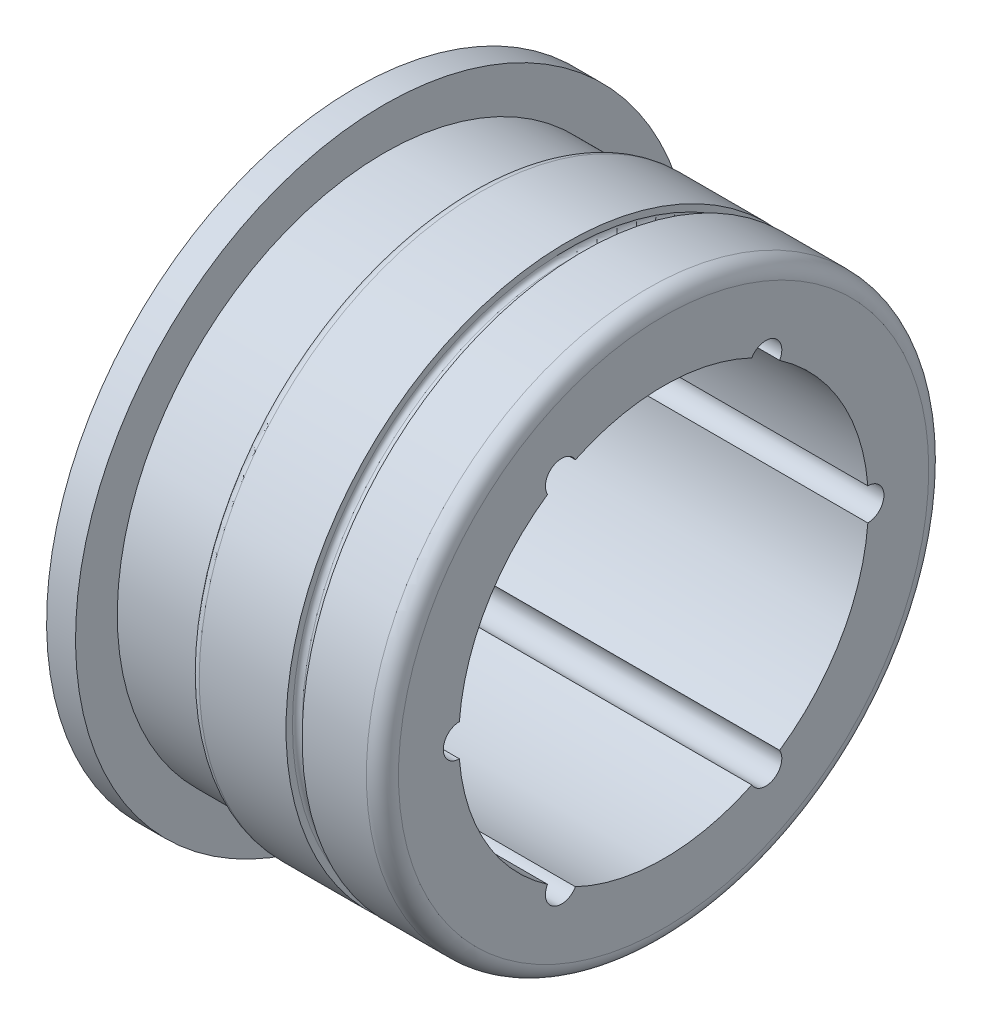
ISO-10303-21;
HEADER;
FILE_DESCRIPTION(('STEP AP214'),'2;1');
FILE_NAME('part.step','',(''),(''),'','','');
FILE_SCHEMA(('AUTOMOTIVE_DESIGN { 1 0 10303 214 1 1 1 1 }'));
ENDSEC;
DATA;
#1=APPLICATION_CONTEXT('core data for automotive mechanical design processes');
#2=APPLICATION_PROTOCOL_DEFINITION('international standard','automotive_design',2000,#1);
#3=PRODUCT_CONTEXT('',#1,'mechanical');
#4=PRODUCT('Part','Part','',(#3));
#5=PRODUCT_RELATED_PRODUCT_CATEGORY('part','',(#4));
#6=PRODUCT_DEFINITION_FORMATION('','',#4);
#7=PRODUCT_DEFINITION_CONTEXT('part definition',#1,'design');
#8=PRODUCT_DEFINITION('design','',#6,#7);
#9=PRODUCT_DEFINITION_SHAPE('','',#8);
#10=(LENGTH_UNIT() NAMED_UNIT(*) SI_UNIT(.MILLI.,.METRE.));
#11=(NAMED_UNIT(*) PLANE_ANGLE_UNIT() SI_UNIT($,.RADIAN.));
#12=(NAMED_UNIT(*) SI_UNIT($,.STERADIAN.) SOLID_ANGLE_UNIT());
#13=UNCERTAINTY_MEASURE_WITH_UNIT(LENGTH_MEASURE(1.E-05),#10,'distance_accuracy_value','');
#14=(GEOMETRIC_REPRESENTATION_CONTEXT(3) GLOBAL_UNCERTAINTY_ASSIGNED_CONTEXT((#13)) GLOBAL_UNIT_ASSIGNED_CONTEXT((#10,
#11,#12)) REPRESENTATION_CONTEXT('',''));
#15=CARTESIAN_POINT('',(0.,0.,0.));
#16=DIRECTION('',(0.,0.,1.));
#17=DIRECTION('',(1.,0.,0.));
#18=AXIS2_PLACEMENT_3D('',#15,#16,#17);
#19=CARTESIAN_POINT('',(28.,-17.770939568,17.71));
#20=DIRECTION('',(1.,0.,0.));
#21=DIRECTION('',(0.,0.,-1.));
#22=AXIS2_PLACEMENT_3D('',#19,#20,#21);
#23=PLANE('',#22);
#24=CARTESIAN_POINT('',(28.,0.,0.));
#25=DIRECTION('',(1.,0.,0.));
#26=DIRECTION('',(0.,0.,-1.));
#27=AXIS2_PLACEMENT_3D('',#24,#25,#26);
#28=CIRCLE('',#27,17.1);
#29=CARTESIAN_POINT('',(28.,0.,-17.1));
#30=VERTEX_POINT('',#29);
#31=EDGE_CURVE('E226',#30,#30,#28,.F.);
#32=ORIENTED_EDGE('',*,*,#31,.T.);
#33=EDGE_LOOP('',(#32));
#34=FACE_BOUND('',#33,.T.);
#35=CARTESIAN_POINT('',(28.,0.,0.));
#36=DIRECTION('',(1.,0.,0.));
#37=DIRECTION('',(0.,0.,-1.));
#38=AXIS2_PLACEMENT_3D('',#35,#36,#37);
#39=CIRCLE('',#38,17.5);
#40=CARTESIAN_POINT('',(28.,0.,-17.5));
#41=VERTEX_POINT('',#40);
#42=EDGE_CURVE('E36',#41,#41,#39,.F.);
#43=ORIENTED_EDGE('',*,*,#42,.F.);
#44=EDGE_LOOP('',(#43));
#45=FACE_BOUND('',#44,.T.);
#46=ADVANCED_FACE('F32',(#34,#45),#23,.T.);
#47=CARTESIAN_POINT('',(22.6,0.,0.));
#48=DIRECTION('',(1.,0.,0.));
#49=DIRECTION('',(0.,0.,-1.));
#50=AXIS2_PLACEMENT_3D('',#47,#48,#49);
#51=CYLINDRICAL_SURFACE('',#50,17.5);
#52=CARTESIAN_POINT('',(22.6,0.,0.));
#53=DIRECTION('',(-1.,0.,0.));
#54=DIRECTION('',(0.,0.,1.));
#55=AXIS2_PLACEMENT_3D('',#52,#53,#54);
#56=CIRCLE('',#55,17.5);
#57=CARTESIAN_POINT('',(22.6,0.,17.5));
#58=VERTEX_POINT('',#57);
#59=EDGE_CURVE('E228',#58,#58,#56,.T.);
#60=ORIENTED_EDGE('',*,*,#59,.F.);
#61=EDGE_LOOP('',(#60));
#62=FACE_BOUND('',#61,.T.);
#63=ORIENTED_EDGE('',*,*,#42,.T.);
#64=EDGE_LOOP('',(#63));
#65=FACE_BOUND('',#64,.T.);
#66=ADVANCED_FACE('F236',(#62,#65),#51,.T.);
#67=CARTESIAN_POINT('',(28.3,0.,0.));
#68=DIRECTION('',(1.,0.,0.));
#69=DIRECTION('',(0.,0.,-1.));
#70=AXIS2_PLACEMENT_3D('',#67,#68,#69);
#71=TOROIDAL_SURFACE('',#70,17.1,0.299999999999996);
#72=ORIENTED_EDGE('',*,*,#31,.F.);
#73=EDGE_LOOP('',(#72));
#74=FACE_BOUND('',#73,.T.);
#75=CARTESIAN_POINT('',(28.3,0.,0.));
#76=DIRECTION('',(1.,0.,0.));
#77=DIRECTION('',(0.,0.,-1.));
#78=AXIS2_PLACEMENT_3D('',#75,#76,#77);
#79=CIRCLE('',#78,16.8);
#80=CARTESIAN_POINT('',(28.3,0.,-16.8));
#81=VERTEX_POINT('',#80);
#82=EDGE_CURVE('E225',#81,#81,#79,.T.);
#83=ORIENTED_EDGE('',*,*,#82,.F.);
#84=EDGE_LOOP('',(#83));
#85=FACE_BOUND('',#84,.T.);
#86=ADVANCED_FACE('F243',(#74,#85),#71,.F.);
#87=CARTESIAN_POINT('',(22.6,0.,0.));
#88=DIRECTION('',(1.,0.,0.));
#89=DIRECTION('',(0.,0.,-1.));
#90=AXIS2_PLACEMENT_3D('',#87,#88,#89);
#91=TOROIDAL_SURFACE('',#90,16.9,0.600000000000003);
#92=CARTESIAN_POINT('',(22.,0.,0.));
#93=DIRECTION('',(1.,0.,0.));
#94=DIRECTION('',(0.,0.,-1.));
#95=AXIS2_PLACEMENT_3D('',#92,#93,#94);
#96=CIRCLE('',#95,16.8999999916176);
#97=CARTESIAN_POINT('',(22.,0.,-16.8999999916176));
#98=VERTEX_POINT('',#97);
#99=EDGE_CURVE('E223',#98,#98,#96,.F.);
#100=ORIENTED_EDGE('',*,*,#99,.F.);
#101=EDGE_LOOP('',(#100));
#102=FACE_BOUND('',#101,.T.);
#103=ORIENTED_EDGE('',*,*,#59,.T.);
#104=EDGE_LOOP('',(#103));
#105=FACE_BOUND('',#104,.T.);
#106=ADVANCED_FACE('F313',(#102,#105),#91,.T.);
#107=CARTESIAN_POINT('',(28.3,0.,0.));
#108=DIRECTION('',(1.,0.,0.));
#109=DIRECTION('',(0.,1.,0.));
#110=AXIS2_PLACEMENT_3D('',#107,#108,#109);
#111=CYLINDRICAL_SURFACE('',#110,16.8);
#112=ORIENTED_EDGE('',*,*,#82,.T.);
#113=EDGE_LOOP('',(#112));
#114=FACE_BOUND('',#113,.T.);
#115=CARTESIAN_POINT('',(28.7,0.,0.));
#116=DIRECTION('',(-1.,0.,0.));
#117=DIRECTION('',(0.,-1.,0.));
#118=AXIS2_PLACEMENT_3D('',#115,#116,#117);
#119=CIRCLE('',#118,16.8);
#120=CARTESIAN_POINT('',(28.7,-16.8,0.));
#121=VERTEX_POINT('',#120);
#122=EDGE_CURVE('E222',#121,#121,#119,.T.);
#123=ORIENTED_EDGE('',*,*,#122,.T.);
#124=EDGE_LOOP('',(#123));
#125=FACE_BOUND('',#124,.T.);
#126=ADVANCED_FACE('F310',(#114,#125),#111,.T.);
#127=CARTESIAN_POINT('',(22.,-17.161650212,-17.1028));
#128=DIRECTION('',(-1.,0.,0.));
#129=DIRECTION('',(0.,0.,1.));
#130=AXIS2_PLACEMENT_3D('',#127,#128,#129);
#131=PLANE('',#130);
#132=CARTESIAN_POINT('',(22.,0.,0.));
#133=DIRECTION('',(1.,0.,0.));
#134=DIRECTION('',(0.,1.,0.));
#135=AXIS2_PLACEMENT_3D('',#132,#133,#134);
#136=CIRCLE('',#135,16.6);
#137=CARTESIAN_POINT('',(22.,16.6,0.));
#138=VERTEX_POINT('',#137);
#139=EDGE_CURVE('E219',#138,#138,#136,.F.);
#140=ORIENTED_EDGE('',*,*,#139,.F.);
#141=EDGE_LOOP('',(#140));
#142=FACE_BOUND('',#141,.T.);
#143=ORIENTED_EDGE('',*,*,#99,.T.);
#144=EDGE_LOOP('',(#143));
#145=FACE_BOUND('',#144,.T.);
#146=ADVANCED_FACE('F312',(#142,#145),#131,.T.);
#147=CARTESIAN_POINT('',(28.7,0.,0.));
#148=DIRECTION('',(1.,0.,0.));
#149=DIRECTION('',(0.,1.,0.));
#150=AXIS2_PLACEMENT_3D('',#147,#148,#149);
#151=TOROIDAL_SURFACE('',#150,17.1,0.300000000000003);
#152=ORIENTED_EDGE('',*,*,#122,.F.);
#153=EDGE_LOOP('',(#152));
#154=FACE_BOUND('',#153,.T.);
#155=CARTESIAN_POINT('',(29.,0.,0.));
#156=DIRECTION('',(1.,0.,0.));
#157=DIRECTION('',(0.,1.,0.));
#158=AXIS2_PLACEMENT_3D('',#155,#156,#157);
#159=CIRCLE('',#158,17.09999998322);
#160=CARTESIAN_POINT('',(29.,17.09999998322,0.));
#161=VERTEX_POINT('',#160);
#162=EDGE_CURVE('E216',#161,#161,#159,.T.);
#163=ORIENTED_EDGE('',*,*,#162,.F.);
#164=EDGE_LOOP('',(#163));
#165=FACE_BOUND('',#164,.T.);
#166=ADVANCED_FACE('F308',(#154,#165),#151,.F.);
#167=CARTESIAN_POINT('',(16.6,0.,0.));
#168=DIRECTION('',(1.,0.,0.));
#169=DIRECTION('',(0.,1.,0.));
#170=AXIS2_PLACEMENT_3D('',#167,#168,#169);
#171=CYLINDRICAL_SURFACE('',#170,16.6);
#172=CARTESIAN_POINT('',(16.6,0.,0.));
#173=DIRECTION('',(1.,0.,0.));
#174=DIRECTION('',(0.,1.,0.));
#175=AXIS2_PLACEMENT_3D('',#172,#173,#174);
#176=CIRCLE('',#175,16.6);
#177=CARTESIAN_POINT('',(16.6,16.6,0.));
#178=VERTEX_POINT('',#177);
#179=EDGE_CURVE('E213',#178,#178,#176,.F.);
#180=ORIENTED_EDGE('',*,*,#179,.F.);
#181=EDGE_LOOP('',(#180));
#182=FACE_BOUND('',#181,.T.);
#183=ORIENTED_EDGE('',*,*,#139,.T.);
#184=EDGE_LOOP('',(#183));
#185=FACE_BOUND('',#184,.T.);
#186=ADVANCED_FACE('F304',(#182,#185),#171,.T.);
#187=CARTESIAN_POINT('',(29.,-17.770939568,-17.71));
#188=DIRECTION('',(-1.,0.,0.));
#189=DIRECTION('',(0.,0.,1.));
#190=AXIS2_PLACEMENT_3D('',#187,#188,#189);
#191=PLANE('',#190);
#192=ORIENTED_EDGE('',*,*,#162,.T.);
#193=EDGE_LOOP('',(#192));
#194=FACE_BOUND('',#193,.T.);
#195=CARTESIAN_POINT('',(29.,0.,0.));
#196=DIRECTION('',(1.,0.,0.));
#197=DIRECTION('',(0.,0.,-1.));
#198=AXIS2_PLACEMENT_3D('',#195,#196,#197);
#199=CIRCLE('',#198,17.5);
#200=CARTESIAN_POINT('',(29.,0.,-17.5));
#201=VERTEX_POINT('',#200);
#202=EDGE_CURVE('E210',#201,#201,#199,.T.);
#203=ORIENTED_EDGE('',*,*,#202,.F.);
#204=EDGE_LOOP('',(#203));
#205=FACE_BOUND('',#204,.T.);
#206=ADVANCED_FACE('F307',(#194,#205),#191,.T.);
#207=CARTESIAN_POINT('',(16.6,-19.497259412,19.4304));
#208=DIRECTION('',(1.,0.,0.));
#209=DIRECTION('',(0.,0.,-1.));
#210=AXIS2_PLACEMENT_3D('',#207,#208,#209);
#211=PLANE('',#210);
#212=ORIENTED_EDGE('',*,*,#179,.T.);
#213=EDGE_LOOP('',(#212));
#214=FACE_BOUND('',#213,.T.);
#215=CARTESIAN_POINT('',(16.6,0.,0.));
#216=DIRECTION('',(1.,0.,0.));
#217=DIRECTION('',(0.,1.,0.));
#218=AXIS2_PLACEMENT_3D('',#215,#216,#217);
#219=CIRCLE('',#218,19.2);
#220=CARTESIAN_POINT('',(16.6,19.2,0.));
#221=VERTEX_POINT('',#220);
#222=EDGE_CURVE('E206',#221,#221,#219,.F.);
#223=ORIENTED_EDGE('',*,*,#222,.F.);
#224=EDGE_LOOP('',(#223));
#225=FACE_BOUND('',#224,.T.);
#226=ADVANCED_FACE('F302',(#214,#225),#211,.T.);
#227=CARTESIAN_POINT('',(29.,0.,0.));
#228=DIRECTION('',(1.,0.,0.));
#229=DIRECTION('',(0.,0.,-1.));
#230=AXIS2_PLACEMENT_3D('',#227,#228,#229);
#231=CYLINDRICAL_SURFACE('',#230,17.5);
#232=ORIENTED_EDGE('',*,*,#202,.T.);
#233=EDGE_LOOP('',(#232));
#234=FACE_BOUND('',#233,.T.);
#235=CARTESIAN_POINT('',(33.,0.,0.));
#236=DIRECTION('',(1.,0.,0.));
#237=DIRECTION('',(0.,0.,-1.));
#238=AXIS2_PLACEMENT_3D('',#235,#236,#237);
#239=CIRCLE('',#238,17.5);
#240=CARTESIAN_POINT('',(33.,0.,-17.5));
#241=VERTEX_POINT('',#240);
#242=EDGE_CURVE('E209',#241,#241,#239,.T.);
#243=ORIENTED_EDGE('',*,*,#242,.F.);
#244=EDGE_LOOP('',(#243));
#245=FACE_BOUND('',#244,.T.);
#246=ADVANCED_FACE('F298',(#234,#245),#231,.T.);
#247=CARTESIAN_POINT('',(14.8,0.,0.));
#248=DIRECTION('',(1.,0.,0.));
#249=DIRECTION('',(0.,1.,0.));
#250=AXIS2_PLACEMENT_3D('',#247,#248,#249);
#251=CYLINDRICAL_SURFACE('',#250,19.2);
#252=CARTESIAN_POINT('',(14.8,0.,0.));
#253=DIRECTION('',(1.,0.,0.));
#254=DIRECTION('',(0.,1.,0.));
#255=AXIS2_PLACEMENT_3D('',#252,#253,#254);
#256=CIRCLE('',#255,19.2);
#257=CARTESIAN_POINT('',(14.8,19.2,0.));
#258=VERTEX_POINT('',#257);
#259=EDGE_CURVE('E203',#258,#258,#256,.F.);
#260=ORIENTED_EDGE('',*,*,#259,.F.);
#261=EDGE_LOOP('',(#260));
#262=FACE_BOUND('',#261,.T.);
#263=ORIENTED_EDGE('',*,*,#222,.T.);
#264=EDGE_LOOP('',(#263));
#265=FACE_BOUND('',#264,.T.);
#266=ADVANCED_FACE('F295',(#262,#265),#251,.T.);
#267=CARTESIAN_POINT('',(33.,0.,0.));
#268=DIRECTION('',(1.,0.,0.));
#269=DIRECTION('',(0.,0.,-1.));
#270=AXIS2_PLACEMENT_3D('',#267,#268,#269);
#271=TOROIDAL_SURFACE('',#270,16.5,1.);
#272=ORIENTED_EDGE('',*,*,#242,.T.);
#273=EDGE_LOOP('',(#272));
#274=FACE_BOUND('',#273,.T.);
#275=CARTESIAN_POINT('',(34.,0.,0.));
#276=DIRECTION('',(1.,0.,0.));
#277=DIRECTION('',(0.,0.,-1.));
#278=AXIS2_PLACEMENT_3D('',#275,#276,#277);
#279=CIRCLE('',#278,16.499999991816);
#280=CARTESIAN_POINT('',(34.,0.,-16.499999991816));
#281=VERTEX_POINT('',#280);
#282=EDGE_CURVE('E173',#281,#281,#279,.T.);
#283=ORIENTED_EDGE('',*,*,#282,.F.);
#284=EDGE_LOOP('',(#283));
#285=FACE_BOUND('',#284,.T.);
#286=ADVANCED_FACE('F293',(#274,#285),#271,.T.);
#287=CARTESIAN_POINT('',(34.,11.007809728,-6.355361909));
#288=DIRECTION('',(-1.,0.,0.));
#289=DIRECTION('',(0.,0.,1.));
#290=AXIS2_PLACEMENT_3D('',#287,#288,#289);
#291=CYLINDRICAL_SURFACE('',#290,1.);
#292=DIRECTION('',(1.,0.,0.));
#293=VECTOR('',#292,1.);
#294=CARTESIAN_POINT('',(24.4,10.5078097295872,-7.22138731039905));
#295=LINE('',#294,#293);
#296=CARTESIAN_POINT('',(14.8,10.5078097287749,-7.22138731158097));
#297=VERTEX_POINT('',#296);
#298=CARTESIAN_POINT('',(34.,10.5078097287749,-7.22138731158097));
#299=VERTEX_POINT('',#298);
#300=EDGE_CURVE('E334',#297,#299,#295,.T.);
#301=ORIENTED_EDGE('',*,*,#300,.T.);
#302=CARTESIAN_POINT('',(34.,11.007809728,-6.355361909));
#303=DIRECTION('',(-1.,0.,0.));
#304=DIRECTION('',(0.,0.,1.));
#305=AXIS2_PLACEMENT_3D('',#302,#303,#304);
#306=CIRCLE('',#305,1.);
#307=CARTESIAN_POINT('',(34.,11.5078097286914,-5.48933650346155));
#308=VERTEX_POINT('',#307);
#309=EDGE_CURVE('E169',#308,#299,#306,.T.);
#310=ORIENTED_EDGE('',*,*,#309,.F.);
#311=DIRECTION('',(-1.,0.,0.));
#312=VECTOR('',#311,1.);
#313=CARTESIAN_POINT('',(24.4,11.5078097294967,-5.4893365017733));
#314=LINE('',#313,#312);
#315=CARTESIAN_POINT('',(14.8,11.5078097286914,-5.48933650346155));
#316=VERTEX_POINT('',#315);
#317=EDGE_CURVE('E98',#308,#316,#314,.T.);
#318=ORIENTED_EDGE('',*,*,#317,.T.);
#319=CARTESIAN_POINT('',(14.8,11.007809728,-6.355361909));
#320=DIRECTION('',(-1.,0.,0.));
#321=DIRECTION('',(0.,0.,1.));
#322=AXIS2_PLACEMENT_3D('',#319,#320,#321);
#323=CIRCLE('',#322,1.);
#324=EDGE_CURVE('E177',#297,#316,#323,.F.);
#325=ORIENTED_EDGE('',*,*,#324,.F.);
#326=EDGE_LOOP('',(#301,#310,#318,#325));
#327=FACE_BOUND('',#326,.T.);
#328=ADVANCED_FACE('F289',(#327),#291,.F.);
#329=CARTESIAN_POINT('',(14.8,0.,0.));
#330=DIRECTION('',(1.,0.,0.));
#331=DIRECTION('',(0.,1.,0.));
#332=AXIS2_PLACEMENT_3D('',#329,#330,#331);
#333=CYLINDRICAL_SURFACE('',#332,12.75);
#334=CARTESIAN_POINT('',(14.8,0.,0.));
#335=DIRECTION('',(1.,0.,0.));
#336=DIRECTION('',(0.,1.,0.));
#337=AXIS2_PLACEMENT_3D('',#334,#335,#336);
#338=CIRCLE('',#337,12.75);
#339=CARTESIAN_POINT('',(14.8,0.999999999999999,-12.7107238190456));
#340=VERTEX_POINT('',#339);
#341=EDGE_CURVE('E179',#340,#297,#338,.T.);
#342=ORIENTED_EDGE('',*,*,#341,.F.);
#343=DIRECTION('',(1.,0.,0.));
#344=VECTOR('',#343,1.);
#345=CARTESIAN_POINT('',(24.4,0.999999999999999,-12.7107238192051));
#346=LINE('',#345,#344);
#347=CARTESIAN_POINT('',(34.,0.999999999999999,-12.7107238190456));
#348=VERTEX_POINT('',#347);
#349=EDGE_CURVE('E339',#340,#348,#346,.T.);
#350=ORIENTED_EDGE('',*,*,#349,.T.);
#351=CARTESIAN_POINT('',(34.,0.,0.));
#352=DIRECTION('',(1.,0.,0.));
#353=DIRECTION('',(0.,1.,0.));
#354=AXIS2_PLACEMENT_3D('',#351,#352,#353);
#355=CIRCLE('',#354,12.75);
#356=EDGE_CURVE('E167',#299,#348,#355,.F.);
#357=ORIENTED_EDGE('',*,*,#356,.F.);
#358=ORIENTED_EDGE('',*,*,#300,.F.);
#359=EDGE_LOOP('',(#342,#350,#357,#358));
#360=FACE_BOUND('',#359,.T.);
#361=ADVANCED_FACE('F285',(#360),#333,.F.);
#362=CARTESIAN_POINT('',(34.,0.,-12.710723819));
#363=DIRECTION('',(-1.,0.,0.));
#364=DIRECTION('',(0.,0.,1.));
#365=AXIS2_PLACEMENT_3D('',#362,#363,#364);
#366=CYLINDRICAL_SURFACE('',#365,0.999999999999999);
#367=DIRECTION('',(1.,0.,0.));
#368=VECTOR('',#367,1.);
#369=CARTESIAN_POINT('',(24.4,-0.999999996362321,-12.7107238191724));
#370=LINE('',#369,#368);
#371=CARTESIAN_POINT('',(14.8,-0.99999999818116,-12.7107238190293));
#372=VERTEX_POINT('',#371);
#373=CARTESIAN_POINT('',(34.,-0.99999999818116,-12.7107238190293));
#374=VERTEX_POINT('',#373);
#375=EDGE_CURVE('E342',#372,#374,#370,.T.);
#376=ORIENTED_EDGE('',*,*,#375,.T.);
#377=CARTESIAN_POINT('',(34.,0.,-12.710723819));
#378=DIRECTION('',(-1.,0.,0.));
#379=DIRECTION('',(0.,0.,1.));
#380=AXIS2_PLACEMENT_3D('',#377,#378,#379);
#381=CIRCLE('',#380,0.999999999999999);
#382=EDGE_CURVE('E165',#348,#374,#381,.T.);
#383=ORIENTED_EDGE('',*,*,#382,.F.);
#384=ORIENTED_EDGE('',*,*,#349,.F.);
#385=CARTESIAN_POINT('',(14.8,0.,-12.710723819));
#386=DIRECTION('',(-1.,0.,0.));
#387=DIRECTION('',(0.,0.,1.));
#388=AXIS2_PLACEMENT_3D('',#385,#386,#387);
#389=CIRCLE('',#388,0.999999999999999);
#390=EDGE_CURVE('E182',#372,#340,#389,.F.);
#391=ORIENTED_EDGE('',*,*,#390,.F.);
#392=EDGE_LOOP('',(#376,#383,#384,#391));
#393=FACE_BOUND('',#392,.T.);
#394=ADVANCED_FACE('F281',(#393),#366,.F.);
#395=CARTESIAN_POINT('',(14.8,0.,0.));
#396=DIRECTION('',(1.,0.,0.));
#397=DIRECTION('',(0.,1.,0.));
#398=AXIS2_PLACEMENT_3D('',#395,#396,#397);
#399=CYLINDRICAL_SURFACE('',#398,12.75);
#400=CARTESIAN_POINT('',(14.8,0.,0.));
#401=DIRECTION('',(1.,0.,0.));
#402=DIRECTION('',(0.,1.,0.));
#403=AXIS2_PLACEMENT_3D('',#400,#401,#402);
#404=CIRCLE('',#403,12.75);
#405=CARTESIAN_POINT('',(14.8,-10.507809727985,-7.22138731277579));
#406=VERTEX_POINT('',#405);
#407=EDGE_CURVE('E185',#406,#372,#404,.T.);
#408=ORIENTED_EDGE('',*,*,#407,.F.);
#409=DIRECTION('',(1.,0.,0.));
#410=VECTOR('',#409,1.);
#411=CARTESIAN_POINT('',(24.4,-10.5078097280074,-7.22138731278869));
#412=LINE('',#411,#410);
#413=CARTESIAN_POINT('',(34.,-10.507809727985,-7.22138731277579));
#414=VERTEX_POINT('',#413);
#415=EDGE_CURVE('E345',#406,#414,#412,.T.);
#416=ORIENTED_EDGE('',*,*,#415,.T.);
#417=CARTESIAN_POINT('',(34.,0.,0.));
#418=DIRECTION('',(1.,0.,0.));
#419=DIRECTION('',(0.,1.,0.));
#420=AXIS2_PLACEMENT_3D('',#417,#418,#419);
#421=CIRCLE('',#420,12.75);
#422=EDGE_CURVE('E163',#374,#414,#421,.F.);
#423=ORIENTED_EDGE('',*,*,#422,.F.);
#424=ORIENTED_EDGE('',*,*,#375,.F.);
#425=EDGE_LOOP('',(#408,#416,#423,#424));
#426=FACE_BOUND('',#425,.T.);
#427=ADVANCED_FACE('F277',(#426),#399,.F.);
#428=CARTESIAN_POINT('',(34.,-11.007809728,-6.355361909));
#429=DIRECTION('',(-1.,0.,0.));
#430=DIRECTION('',(0.,0.,1.));
#431=AXIS2_PLACEMENT_3D('',#428,#429,#430);
#432=CYLINDRICAL_SURFACE('',#431,1.);
#433=DIRECTION('',(1.,0.,0.));
#434=VECTOR('',#433,1.);
#435=CARTESIAN_POINT('',(24.4,-11.5078097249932,-5.48933651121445));
#436=LINE('',#435,#434);
#437=CARTESIAN_POINT('',(14.8,-11.5078097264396,-5.48933650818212));
#438=VERTEX_POINT('',#437);
#439=CARTESIAN_POINT('',(34.,-11.5078097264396,-5.48933650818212));
#440=VERTEX_POINT('',#439);
#441=EDGE_CURVE('E348',#438,#440,#436,.T.);
#442=ORIENTED_EDGE('',*,*,#441,.T.);
#443=CARTESIAN_POINT('',(34.,-11.007809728,-6.355361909));
#444=DIRECTION('',(-1.,0.,0.));
#445=DIRECTION('',(0.,0.,1.));
#446=AXIS2_PLACEMENT_3D('',#443,#444,#445);
#447=CIRCLE('',#446,1.);
#448=EDGE_CURVE('E161',#414,#440,#447,.T.);
#449=ORIENTED_EDGE('',*,*,#448,.F.);
#450=ORIENTED_EDGE('',*,*,#415,.F.);
#451=CARTESIAN_POINT('',(14.8,-11.007809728,-6.355361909));
#452=DIRECTION('',(-1.,0.,0.));
#453=DIRECTION('',(0.,0.,1.));
#454=AXIS2_PLACEMENT_3D('',#451,#452,#453);
#455=CIRCLE('',#454,1.);
#456=EDGE_CURVE('E188',#438,#406,#455,.F.);
#457=ORIENTED_EDGE('',*,*,#456,.F.);
#458=EDGE_LOOP('',(#442,#449,#450,#457));
#459=FACE_BOUND('',#458,.T.);
#460=ADVANCED_FACE('F273',(#459),#432,.F.);
#461=CARTESIAN_POINT('',(14.8,0.,0.));
#462=DIRECTION('',(1.,0.,0.));
#463=DIRECTION('',(0.,1.,0.));
#464=AXIS2_PLACEMENT_3D('',#461,#462,#463);
#465=CYLINDRICAL_SURFACE('',#464,12.75);
#466=CARTESIAN_POINT('',(14.8,0.,0.));
#467=DIRECTION('',(1.,0.,0.));
#468=DIRECTION('',(0.,1.,0.));
#469=AXIS2_PLACEMENT_3D('',#466,#467,#468);
#470=CIRCLE('',#469,12.75);
#471=CARTESIAN_POINT('',(14.8,-11.5078097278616,5.48933650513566));
#472=VERTEX_POINT('',#471);
#473=EDGE_CURVE('E191',#472,#438,#470,.T.);
#474=ORIENTED_EDGE('',*,*,#473,.F.);
#475=DIRECTION('',(1.,0.,0.));
#476=VECTOR('',#475,1.);
#477=CARTESIAN_POINT('',(24.4,-11.5078097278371,5.48933650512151));
#478=LINE('',#477,#476);
#479=CARTESIAN_POINT('',(34.,-11.5078097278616,5.48933650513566));
#480=VERTEX_POINT('',#479);
#481=EDGE_CURVE('E351',#472,#480,#478,.T.);
#482=ORIENTED_EDGE('',*,*,#481,.T.);
#483=CARTESIAN_POINT('',(34.,0.,0.));
#484=DIRECTION('',(1.,0.,0.));
#485=DIRECTION('',(0.,1.,0.));
#486=AXIS2_PLACEMENT_3D('',#483,#484,#485);
#487=CIRCLE('',#486,12.75);
#488=EDGE_CURVE('E158',#440,#480,#487,.F.);
#489=ORIENTED_EDGE('',*,*,#488,.F.);
#490=ORIENTED_EDGE('',*,*,#441,.F.);
#491=EDGE_LOOP('',(#474,#482,#489,#490));
#492=FACE_BOUND('',#491,.T.);
#493=ADVANCED_FACE('F269',(#492),#465,.F.);
#494=CARTESIAN_POINT('',(34.,-11.007809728,6.355361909));
#495=DIRECTION('',(-1.,0.,0.));
#496=DIRECTION('',(0.,0.,1.));
#497=AXIS2_PLACEMENT_3D('',#494,#495,#496);
#498=CYLINDRICAL_SURFACE('',#497,1.);
#499=CARTESIAN_POINT('',(34.,-11.007809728,6.355361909));
#500=DIRECTION('',(-1.,0.,0.));
#501=DIRECTION('',(0.,0.,1.));
#502=AXIS2_PLACEMENT_3D('',#499,#500,#501);
#503=CIRCLE('',#502,1.);
#504=CARTESIAN_POINT('',(34.,-10.5078097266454,7.22138731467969));
#505=VERTEX_POINT('',#504);
#506=EDGE_CURVE('E156',#480,#505,#503,.T.);
#507=ORIENTED_EDGE('',*,*,#506,.F.);
#508=ORIENTED_EDGE('',*,*,#481,.F.);
#509=CARTESIAN_POINT('',(14.8,-11.007809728,6.355361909));
#510=DIRECTION('',(-1.,0.,0.));
#511=DIRECTION('',(0.,0.,1.));
#512=AXIS2_PLACEMENT_3D('',#509,#510,#511);
#513=CIRCLE('',#512,1.);
#514=CARTESIAN_POINT('',(14.8,-10.5078097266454,7.22138731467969));
#515=VERTEX_POINT('',#514);
#516=EDGE_CURVE('E194',#515,#472,#513,.F.);
#517=ORIENTED_EDGE('',*,*,#516,.F.);
#518=DIRECTION('',(1.,0.,0.));
#519=VECTOR('',#518,1.);
#520=CARTESIAN_POINT('',(24.4,-10.5078097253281,7.22138731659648));
#521=LINE('',#520,#519);
#522=EDGE_CURVE('E354',#515,#505,#521,.T.);
#523=ORIENTED_EDGE('',*,*,#522,.T.);
#524=EDGE_LOOP('',(#507,#508,#517,#523));
#525=FACE_BOUND('',#524,.T.);
#526=ADVANCED_FACE('F265',(#525),#498,.F.);
#527=CARTESIAN_POINT('',(14.8,0.,0.));
#528=DIRECTION('',(1.,0.,0.));
#529=DIRECTION('',(0.,1.,0.));
#530=AXIS2_PLACEMENT_3D('',#527,#528,#529);
#531=CYLINDRICAL_SURFACE('',#530,12.75);
#532=CARTESIAN_POINT('',(14.8,0.,0.));
#533=DIRECTION('',(1.,0.,0.));
#534=DIRECTION('',(0.,1.,0.));
#535=AXIS2_PLACEMENT_3D('',#532,#533,#534);
#536=CIRCLE('',#535,12.75);
#537=CARTESIAN_POINT('',(14.8,-1.,12.7107238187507));
#538=VERTEX_POINT('',#537);
#539=EDGE_CURVE('E197',#538,#515,#536,.T.);
#540=ORIENTED_EDGE('',*,*,#539,.F.);
#541=DIRECTION('',(1.,0.,0.));
#542=VECTOR('',#541,1.);
#543=CARTESIAN_POINT('',(24.4,-1.,12.7107238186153));
#544=LINE('',#543,#542);
#545=CARTESIAN_POINT('',(34.,-1.,12.7107238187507));
#546=VERTEX_POINT('',#545);
#547=EDGE_CURVE('E145',#538,#546,#544,.T.);
#548=ORIENTED_EDGE('',*,*,#547,.T.);
#549=CARTESIAN_POINT('',(34.,0.,0.));
#550=DIRECTION('',(1.,0.,0.));
#551=DIRECTION('',(0.,1.,0.));
#552=AXIS2_PLACEMENT_3D('',#549,#550,#551);
#553=CIRCLE('',#552,12.75);
#554=EDGE_CURVE('E134',#505,#546,#553,.F.);
#555=ORIENTED_EDGE('',*,*,#554,.F.);
#556=ORIENTED_EDGE('',*,*,#522,.F.);
#557=EDGE_LOOP('',(#540,#548,#555,#556));
#558=FACE_BOUND('',#557,.T.);
#559=ADVANCED_FACE('F262',(#558),#531,.F.);
#560=CARTESIAN_POINT('',(34.,0.,12.710723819));
#561=DIRECTION('',(-1.,0.,0.));
#562=DIRECTION('',(0.,0.,1.));
#563=AXIS2_PLACEMENT_3D('',#560,#561,#562);
#564=CYLINDRICAL_SURFACE('',#563,1.);
#565=CARTESIAN_POINT('',(34.,0.,12.710723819));
#566=DIRECTION('',(-1.,0.,0.));
#567=DIRECTION('',(0.,0.,1.));
#568=AXIS2_PLACEMENT_3D('',#565,#566,#567);
#569=CIRCLE('',#568,1.);
#570=CARTESIAN_POINT('',(34.,1.00000000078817,12.7107238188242));
#571=VERTEX_POINT('',#570);
#572=EDGE_CURVE('E128',#546,#571,#569,.T.);
#573=ORIENTED_EDGE('',*,*,#572,.F.);
#574=ORIENTED_EDGE('',*,*,#547,.F.);
#575=CARTESIAN_POINT('',(14.8,0.,12.710723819));
#576=DIRECTION('',(-1.,0.,0.));
#577=DIRECTION('',(0.,0.,1.));
#578=AXIS2_PLACEMENT_3D('',#575,#576,#577);
#579=CIRCLE('',#578,1.);
#580=CARTESIAN_POINT('',(14.8,1.00000000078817,12.7107238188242));
#581=VERTEX_POINT('',#580);
#582=EDGE_CURVE('E143',#581,#538,#579,.F.);
#583=ORIENTED_EDGE('',*,*,#582,.F.);
#584=DIRECTION('',(1.,0.,0.));
#585=VECTOR('',#584,1.);
#586=CARTESIAN_POINT('',(24.4,1.00000000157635,12.7107238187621));
#587=LINE('',#586,#585);
#588=EDGE_CURVE('E140',#581,#571,#587,.T.);
#589=ORIENTED_EDGE('',*,*,#588,.T.);
#590=EDGE_LOOP('',(#573,#574,#583,#589));
#591=FACE_BOUND('',#590,.T.);
#592=ADVANCED_FACE('F141',(#591),#564,.F.);
#593=CARTESIAN_POINT('',(14.8,0.,0.));
#594=DIRECTION('',(1.,0.,0.));
#595=DIRECTION('',(0.,1.,0.));
#596=AXIS2_PLACEMENT_3D('',#593,#594,#595);
#597=CYLINDRICAL_SURFACE('',#596,12.75);
#598=CARTESIAN_POINT('',(34.,0.,0.));
#599=DIRECTION('',(1.,0.,0.));
#600=DIRECTION('',(0.,1.,0.));
#601=AXIS2_PLACEMENT_3D('',#598,#599,#600);
#602=CIRCLE('',#601,12.75);
#603=CARTESIAN_POINT('',(34.,10.5078097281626,7.22138731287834));
#604=VERTEX_POINT('',#603);
#605=EDGE_CURVE('E132',#571,#604,#602,.F.);
#606=ORIENTED_EDGE('',*,*,#605,.F.);
#607=ORIENTED_EDGE('',*,*,#588,.F.);
#608=CARTESIAN_POINT('',(14.8,0.,0.));
#609=DIRECTION('',(1.,0.,0.));
#610=DIRECTION('',(0.,1.,0.));
#611=AXIS2_PLACEMENT_3D('',#608,#609,#610);
#612=CIRCLE('',#611,12.75);
#613=CARTESIAN_POINT('',(14.8,10.5078097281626,7.22138731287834));
#614=VERTEX_POINT('',#613);
#615=EDGE_CURVE('E201',#614,#581,#612,.T.);
#616=ORIENTED_EDGE('',*,*,#615,.F.);
#617=DIRECTION('',(1.,0.,0.));
#618=VECTOR('',#617,1.);
#619=CARTESIAN_POINT('',(24.4,10.5078097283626,7.22138731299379));
#620=LINE('',#619,#618);
#621=EDGE_CURVE('E148',#614,#604,#620,.T.);
#622=ORIENTED_EDGE('',*,*,#621,.T.);
#623=EDGE_LOOP('',(#606,#607,#616,#622));
#624=FACE_BOUND('',#623,.T.);
#625=ADVANCED_FACE('F147',(#624),#597,.F.);
#626=CARTESIAN_POINT('',(14.8,0.,0.));
#627=DIRECTION('',(1.,0.,0.));
#628=DIRECTION('',(0.,1.,0.));
#629=AXIS2_PLACEMENT_3D('',#626,#627,#628);
#630=CYLINDRICAL_SURFACE('',#629,12.75);
#631=CARTESIAN_POINT('',(14.8,0.,0.));
#632=DIRECTION('',(1.,0.,0.));
#633=DIRECTION('',(0.,1.,0.));
#634=AXIS2_PLACEMENT_3D('',#631,#632,#633);
#635=CIRCLE('',#634,12.75);
#636=CARTESIAN_POINT('',(14.8,11.5078097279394,5.48933650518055));
#637=VERTEX_POINT('',#636);
#638=EDGE_CURVE('E51',#316,#637,#635,.T.);
#639=ORIENTED_EDGE('',*,*,#638,.F.);
#640=ORIENTED_EDGE('',*,*,#317,.F.);
#641=CARTESIAN_POINT('',(34.,0.,0.));
#642=DIRECTION('',(1.,0.,0.));
#643=DIRECTION('',(0.,1.,0.));
#644=AXIS2_PLACEMENT_3D('',#641,#642,#643);
#645=CIRCLE('',#644,12.75);
#646=CARTESIAN_POINT('',(34.,11.5078097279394,5.48933650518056));
#647=VERTEX_POINT('',#646);
#648=EDGE_CURVE('E171',#647,#308,#645,.F.);
#649=ORIENTED_EDGE('',*,*,#648,.F.);
#650=DIRECTION('',(-1.,0.,0.));
#651=VECTOR('',#650,1.);
#652=CARTESIAN_POINT('',(24.4,11.5078097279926,5.48933650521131));
#653=LINE('',#652,#651);
#654=EDGE_CURVE('E149',#647,#637,#653,.T.);
#655=ORIENTED_EDGE('',*,*,#654,.T.);
#656=EDGE_LOOP('',(#639,#640,#649,#655));
#657=FACE_BOUND('',#656,.T.);
#658=ADVANCED_FACE('F255',(#657),#630,.F.);
#659=CARTESIAN_POINT('',(14.8,-19.497259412,-19.4304));
#660=DIRECTION('',(-1.,0.,0.));
#661=DIRECTION('',(0.,0.,1.));
#662=AXIS2_PLACEMENT_3D('',#659,#660,#661);
#663=PLANE('',#662);
#664=ORIENTED_EDGE('',*,*,#638,.T.);
#665=CARTESIAN_POINT('',(14.8,11.007809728,6.355361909));
#666=DIRECTION('',(-1.,0.,0.));
#667=DIRECTION('',(0.,0.,1.));
#668=AXIS2_PLACEMENT_3D('',#665,#666,#667);
#669=CIRCLE('',#668,1.);
#670=EDGE_CURVE('E42',#637,#614,#669,.F.);
#671=ORIENTED_EDGE('',*,*,#670,.T.);
#672=ORIENTED_EDGE('',*,*,#615,.T.);
#673=ORIENTED_EDGE('',*,*,#582,.T.);
#674=ORIENTED_EDGE('',*,*,#539,.T.);
#675=ORIENTED_EDGE('',*,*,#516,.T.);
#676=ORIENTED_EDGE('',*,*,#473,.T.);
#677=ORIENTED_EDGE('',*,*,#456,.T.);
#678=ORIENTED_EDGE('',*,*,#407,.T.);
#679=ORIENTED_EDGE('',*,*,#390,.T.);
#680=ORIENTED_EDGE('',*,*,#341,.T.);
#681=ORIENTED_EDGE('',*,*,#324,.T.);
#682=EDGE_LOOP('',(#664,#671,#672,#673,#674,#675,#676,#677,#678,#679,#680,#681));
#683=FACE_BOUND('',#682,.T.);
#684=ORIENTED_EDGE('',*,*,#259,.T.);
#685=EDGE_LOOP('',(#684));
#686=FACE_BOUND('',#685,.T.);
#687=ADVANCED_FACE('F253',(#683,#686),#663,.T.);
#688=CARTESIAN_POINT('',(34.,-16.755457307,16.698));
#689=DIRECTION('',(1.,0.,0.));
#690=DIRECTION('',(0.,0.,-1.));
#691=AXIS2_PLACEMENT_3D('',#688,#689,#690);
#692=PLANE('',#691);
#693=ORIENTED_EDGE('',*,*,#572,.T.);
#694=ORIENTED_EDGE('',*,*,#605,.T.);
#695=CARTESIAN_POINT('',(34.,11.007809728,6.355361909));
#696=DIRECTION('',(-1.,0.,0.));
#697=DIRECTION('',(0.,0.,1.));
#698=AXIS2_PLACEMENT_3D('',#695,#696,#697);
#699=CIRCLE('',#698,1.);
#700=EDGE_CURVE('E11',#604,#647,#699,.T.);
#701=ORIENTED_EDGE('',*,*,#700,.T.);
#702=ORIENTED_EDGE('',*,*,#648,.T.);
#703=ORIENTED_EDGE('',*,*,#309,.T.);
#704=ORIENTED_EDGE('',*,*,#356,.T.);
#705=ORIENTED_EDGE('',*,*,#382,.T.);
#706=ORIENTED_EDGE('',*,*,#422,.T.);
#707=ORIENTED_EDGE('',*,*,#448,.T.);
#708=ORIENTED_EDGE('',*,*,#488,.T.);
#709=ORIENTED_EDGE('',*,*,#506,.T.);
#710=ORIENTED_EDGE('',*,*,#554,.T.);
#711=EDGE_LOOP('',(#693,#694,#701,#702,#703,#704,#705,#706,#707,#708,#709,#710));
#712=FACE_BOUND('',#711,.T.);
#713=ORIENTED_EDGE('',*,*,#282,.T.);
#714=EDGE_LOOP('',(#713));
#715=FACE_BOUND('',#714,.T.);
#716=ADVANCED_FACE('F34',(#712,#715),#692,.T.);
#717=CARTESIAN_POINT('',(34.,11.007809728,6.355361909));
#718=DIRECTION('',(-1.,0.,0.));
#719=DIRECTION('',(0.,0.,1.));
#720=AXIS2_PLACEMENT_3D('',#717,#718,#719);
#721=CYLINDRICAL_SURFACE('',#720,1.);
#722=ORIENTED_EDGE('',*,*,#700,.F.);
#723=ORIENTED_EDGE('',*,*,#621,.F.);
#724=ORIENTED_EDGE('',*,*,#670,.F.);
#725=ORIENTED_EDGE('',*,*,#654,.F.);
#726=EDGE_LOOP('',(#722,#723,#724,#725));
#727=FACE_BOUND('',#726,.T.);
#728=ADVANCED_FACE('F248',(#727),#721,.F.);
#729=CLOSED_SHELL('',(#46,#66,#86,#106,#126,#146,#166,#186,#206,#226,#246,#266,#286,#328,#361,
#394,#427,#460,#493,#526,#559,#592,#625,#658,#687,#716,#728));
#730=MANIFOLD_SOLID_BREP('B2',#729);
#731=ADVANCED_BREP_SHAPE_REPRESENTATION('',(#18,#730),#14);
#732=SHAPE_DEFINITION_REPRESENTATION(#9,#731);
ENDSEC;
END-ISO-10303-21;
